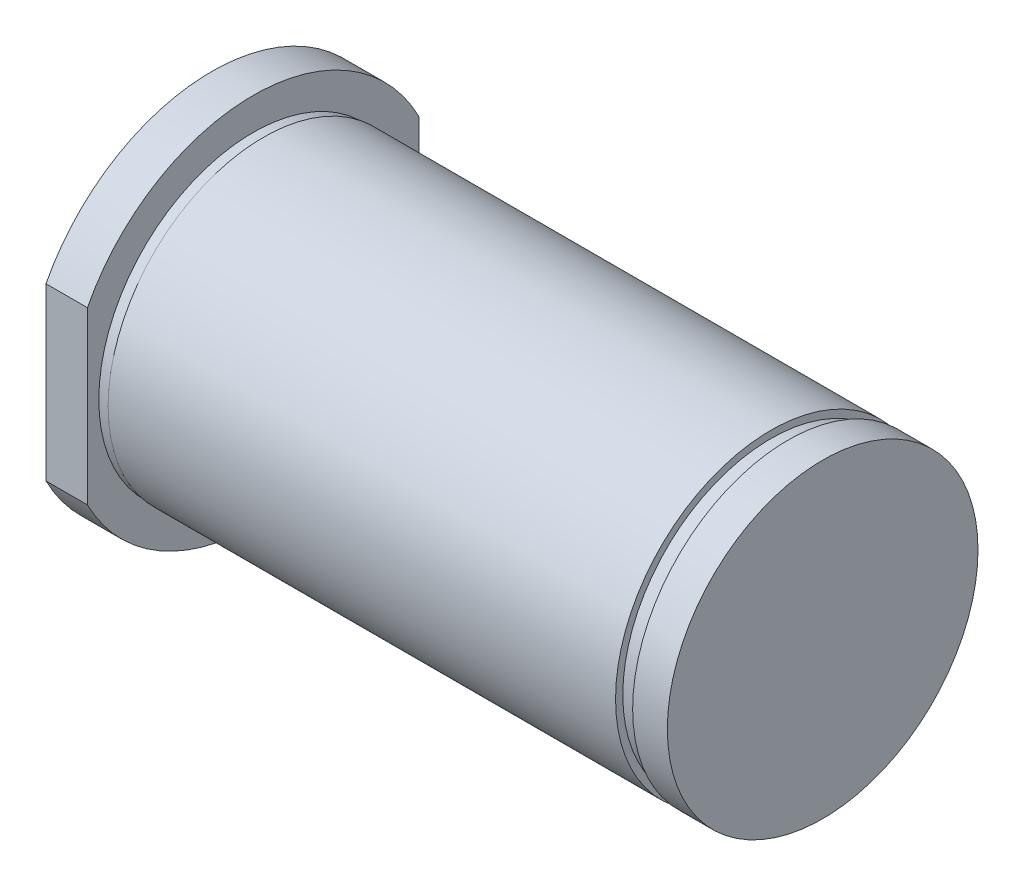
from build123d import *

# Parameters (mm, degrees)
SKETCH3_W          = 42
SKETCH3_H          = 82
SKETCH3_W_2        = 32
SKETCH3_H_2        = 72
CUT_EXTRUDE1_DEPTH = 4


with BuildPart() as part:
    # Sketch1 → Revolve1 (revolve)
    with BuildSketch(Plane.XY, mode=Mode.PRIVATE) as revolve1_sk:
        Polygon((0, 0), (0, 18), (4, 18), (4, 14.9), (5, 14.9), (5, 15), (54, 15), (54, 14.3), (55.65, 14.3), (55.65, 15), (59, 15), (59, 0), align=None)
    revolve(revolve1_sk.sketch.rotate(Axis((59, 0, 0), (-1, 0, 0)), 270), axis=Axis((59, 0, 0), (-1, 0, 0)))

    # Sketch2 → Cut-Revolve1 (revolve, cut)
    with BuildSketch(Plane.XY, mode=Mode.PRIVATE) as cut_revolve1_sk:
        Polygon((0, 0), (0, 8), (1.0825, 6.9175), (31, 6.9175), (34.993820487, 0), align=None)
    revolve(cut_revolve1_sk.sketch.rotate(Axis((34.993820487, 0, 0), (-1, 0, 0)), 270), axis=Axis((34.993820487, 0, 0), (-1, 0, 0)), mode=Mode.SUBTRACT)

    # Sketch3 → Cut-Extrude1 (cut)
    with BuildSketch(Plane(origin=(0, 0, 0), x_dir=(0, 0, -1), z_dir=(1, 0, 0))):
        Rectangle(SKETCH3_W, SKETCH3_H)
        Rectangle(SKETCH3_W_2, SKETCH3_H_2, mode=Mode.SUBTRACT)
    extrude(amount=CUT_EXTRUDE1_DEPTH, mode=Mode.SUBTRACT)


solid = part.part
